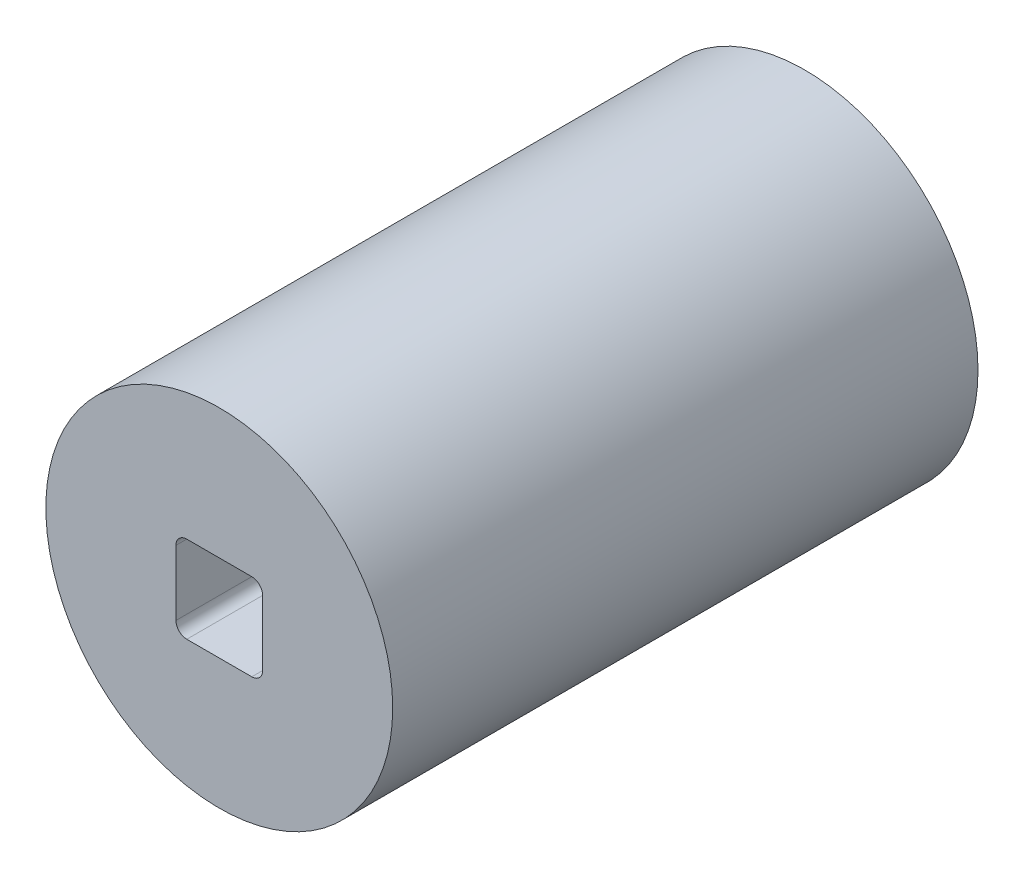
ISO-10303-21;
HEADER;
FILE_DESCRIPTION(('STEP AP214'),'2;1');
FILE_NAME('part.step','',(''),(''),'','','');
FILE_SCHEMA(('AUTOMOTIVE_DESIGN { 1 0 10303 214 1 1 1 1 }'));
ENDSEC;
DATA;
#1=APPLICATION_CONTEXT('core data for automotive mechanical design processes');
#2=APPLICATION_PROTOCOL_DEFINITION('international standard','automotive_design',2000,#1);
#3=PRODUCT_CONTEXT('',#1,'mechanical');
#4=PRODUCT('Part','Part','',(#3));
#5=PRODUCT_RELATED_PRODUCT_CATEGORY('part','',(#4));
#6=PRODUCT_DEFINITION_FORMATION('','',#4);
#7=PRODUCT_DEFINITION_CONTEXT('part definition',#1,'design');
#8=PRODUCT_DEFINITION('design','',#6,#7);
#9=PRODUCT_DEFINITION_SHAPE('','',#8);
#10=(LENGTH_UNIT() NAMED_UNIT(*) SI_UNIT(.MILLI.,.METRE.));
#11=(NAMED_UNIT(*) PLANE_ANGLE_UNIT() SI_UNIT($,.RADIAN.));
#12=(NAMED_UNIT(*) SI_UNIT($,.STERADIAN.) SOLID_ANGLE_UNIT());
#13=UNCERTAINTY_MEASURE_WITH_UNIT(LENGTH_MEASURE(1.E-05),#10,'distance_accuracy_value','');
#14=(GEOMETRIC_REPRESENTATION_CONTEXT(3) GLOBAL_UNCERTAINTY_ASSIGNED_CONTEXT((#13)) GLOBAL_UNIT_ASSIGNED_CONTEXT((#10,
#11,#12)) REPRESENTATION_CONTEXT('',''));
#15=CARTESIAN_POINT('',(0.,0.,0.));
#16=DIRECTION('',(0.,0.,1.));
#17=DIRECTION('',(1.,0.,0.));
#18=AXIS2_PLACEMENT_3D('',#15,#16,#17);
#19=CARTESIAN_POINT('',(0.,0.,-1371.6));
#20=DIRECTION('',(0.,0.,1.));
#21=DIRECTION('',(1.,0.,0.));
#22=AXIS2_PLACEMENT_3D('',#19,#20,#21);
#23=CYLINDRICAL_SURFACE('',#22,406.4);
#24=CARTESIAN_POINT('',(0.,0.,-1371.6));
#25=DIRECTION('',(0.,0.,1.));
#26=DIRECTION('',(1.,0.,0.));
#27=AXIS2_PLACEMENT_3D('',#24,#25,#26);
#28=CIRCLE('',#27,406.4);
#29=CARTESIAN_POINT('',(406.4,0.,-1371.6));
#30=VERTEX_POINT('',#29);
#31=EDGE_CURVE('E53',#30,#30,#28,.T.);
#32=ORIENTED_EDGE('',*,*,#31,.T.);
#33=EDGE_LOOP('',(#32));
#34=FACE_BOUND('',#33,.T.);
#35=CARTESIAN_POINT('',(0.,0.,0.));
#36=DIRECTION('',(0.,0.,1.));
#37=DIRECTION('',(1.,0.,0.));
#38=AXIS2_PLACEMENT_3D('',#35,#36,#37);
#39=CIRCLE('',#38,406.4);
#40=CARTESIAN_POINT('',(406.4,0.,0.));
#41=VERTEX_POINT('',#40);
#42=EDGE_CURVE('E238',#41,#41,#39,.T.);
#43=ORIENTED_EDGE('',*,*,#42,.F.);
#44=EDGE_LOOP('',(#43));
#45=FACE_BOUND('',#44,.T.);
#46=ADVANCED_FACE('F45',(#34,#45),#23,.T.);
#47=CARTESIAN_POINT('',(0.,0.,-1371.6));
#48=DIRECTION('',(0.,0.,1.));
#49=DIRECTION('',(1.,0.,0.));
#50=AXIS2_PLACEMENT_3D('',#47,#48,#49);
#51=PLANE('',#50);
#52=ORIENTED_EDGE('',*,*,#31,.F.);
#53=EDGE_LOOP('',(#52));
#54=FACE_BOUND('',#53,.T.);
#55=ADVANCED_FACE('F268',(#54),#51,.F.);
#56=CARTESIAN_POINT('',(0.,0.,0.));
#57=DIRECTION('',(0.,0.,1.));
#58=DIRECTION('',(1.,0.,0.));
#59=AXIS2_PLACEMENT_3D('',#56,#57,#58);
#60=PLANE('',#59);
#61=DIRECTION('',(0.,-1.,0.));
#62=VECTOR('',#61,1.);
#63=CARTESIAN_POINT('',(-101.6,0.,0.));
#64=LINE('',#63,#62);
#65=CARTESIAN_POINT('',(-101.6,76.2,0.));
#66=VERTEX_POINT('',#65);
#67=CARTESIAN_POINT('',(-101.6,-76.2,0.));
#68=VERTEX_POINT('',#67);
#69=EDGE_CURVE('E205',#66,#68,#64,.T.);
#70=ORIENTED_EDGE('',*,*,#69,.F.);
#71=CARTESIAN_POINT('',(-76.2,76.2,0.));
#72=DIRECTION('',(0.,0.,1.));
#73=DIRECTION('',(1.,0.,0.));
#74=AXIS2_PLACEMENT_3D('',#71,#72,#73);
#75=CIRCLE('',#74,25.4);
#76=CARTESIAN_POINT('',(-76.2,101.6,0.));
#77=VERTEX_POINT('',#76);
#78=EDGE_CURVE('E231',#77,#66,#75,.T.);
#79=ORIENTED_EDGE('',*,*,#78,.F.);
#80=DIRECTION('',(1.,0.,0.));
#81=VECTOR('',#80,1.);
#82=CARTESIAN_POINT('',(0.,101.6,0.));
#83=LINE('',#82,#81);
#84=CARTESIAN_POINT('',(76.2,101.6,0.));
#85=VERTEX_POINT('',#84);
#86=EDGE_CURVE('E227',#77,#85,#83,.T.);
#87=ORIENTED_EDGE('',*,*,#86,.T.);
#88=CARTESIAN_POINT('',(76.2,76.2,0.));
#89=DIRECTION('',(0.,0.,1.));
#90=DIRECTION('',(1.,0.,0.));
#91=AXIS2_PLACEMENT_3D('',#88,#89,#90);
#92=CIRCLE('',#91,25.4);
#93=CARTESIAN_POINT('',(101.6,76.2,0.));
#94=VERTEX_POINT('',#93);
#95=EDGE_CURVE('E223',#94,#85,#92,.T.);
#96=ORIENTED_EDGE('',*,*,#95,.F.);
#97=DIRECTION('',(0.,1.,0.));
#98=VECTOR('',#97,1.);
#99=CARTESIAN_POINT('',(101.6,0.,0.));
#100=LINE('',#99,#98);
#101=CARTESIAN_POINT('',(101.6,-76.2,0.));
#102=VERTEX_POINT('',#101);
#103=EDGE_CURVE('E219',#102,#94,#100,.T.);
#104=ORIENTED_EDGE('',*,*,#103,.F.);
#105=CARTESIAN_POINT('',(76.2,-76.2,0.));
#106=DIRECTION('',(0.,0.,1.));
#107=DIRECTION('',(1.,0.,0.));
#108=AXIS2_PLACEMENT_3D('',#105,#106,#107);
#109=CIRCLE('',#108,25.4);
#110=CARTESIAN_POINT('',(76.2,-101.6,0.));
#111=VERTEX_POINT('',#110);
#112=EDGE_CURVE('E215',#111,#102,#109,.T.);
#113=ORIENTED_EDGE('',*,*,#112,.F.);
#114=DIRECTION('',(-1.,0.,0.));
#115=VECTOR('',#114,1.);
#116=CARTESIAN_POINT('',(0.,-101.6,0.));
#117=LINE('',#116,#115);
#118=CARTESIAN_POINT('',(-76.2,-101.6,0.));
#119=VERTEX_POINT('',#118);
#120=EDGE_CURVE('E211',#111,#119,#117,.T.);
#121=ORIENTED_EDGE('',*,*,#120,.T.);
#122=CARTESIAN_POINT('',(-76.2,-76.2,0.));
#123=DIRECTION('',(0.,0.,1.));
#124=DIRECTION('',(1.,0.,0.));
#125=AXIS2_PLACEMENT_3D('',#122,#123,#124);
#126=CIRCLE('',#125,25.4);
#127=EDGE_CURVE('E208',#68,#119,#126,.T.);
#128=ORIENTED_EDGE('',*,*,#127,.F.);
#129=EDGE_LOOP('',(#70,#79,#87,#96,#104,#113,#121,#128));
#130=FACE_BOUND('',#129,.T.);
#131=ORIENTED_EDGE('',*,*,#42,.T.);
#132=EDGE_LOOP('',(#131));
#133=FACE_BOUND('',#132,.T.);
#134=ADVANCED_FACE('F265',(#130,#133),#60,.T.);
#135=CARTESIAN_POINT('',(-101.6,0.,-1330.325));
#136=DIRECTION('',(-1.,0.,0.));
#137=DIRECTION('',(0.,-1.,0.));
#138=AXIS2_PLACEMENT_3D('',#135,#136,#137);
#139=PLANE('',#138);
#140=DIRECTION('',(0.,0.,1.));
#141=VECTOR('',#140,1.);
#142=CARTESIAN_POINT('',(-101.6,-76.2,-1330.325));
#143=LINE('',#142,#141);
#144=CARTESIAN_POINT('',(-101.6,-76.2,-1311.275));
#145=VERTEX_POINT('',#144);
#146=EDGE_CURVE('E66',#145,#68,#143,.T.);
#147=ORIENTED_EDGE('',*,*,#146,.F.);
#148=DIRECTION('',(0.,1.,0.));
#149=VECTOR('',#148,1.);
#150=CARTESIAN_POINT('',(-101.6,0.,-1311.275));
#151=LINE('',#150,#149);
#152=CARTESIAN_POINT('',(-101.6,76.2,-1311.275));
#153=VERTEX_POINT('',#152);
#154=EDGE_CURVE('E60',#145,#153,#151,.T.);
#155=ORIENTED_EDGE('',*,*,#154,.T.);
#156=DIRECTION('',(0.,0.,1.));
#157=VECTOR('',#156,1.);
#158=CARTESIAN_POINT('',(-101.6,76.2,-1330.325));
#159=LINE('',#158,#157);
#160=EDGE_CURVE('E235',#153,#66,#159,.T.);
#161=ORIENTED_EDGE('',*,*,#160,.T.);
#162=ORIENTED_EDGE('',*,*,#69,.T.);
#163=EDGE_LOOP('',(#147,#155,#161,#162));
#164=FACE_BOUND('',#163,.T.);
#165=ADVANCED_FACE('F279',(#164),#139,.F.);
#166=CARTESIAN_POINT('',(-76.2,76.2,-1330.325));
#167=DIRECTION('',(0.,0.,1.));
#168=DIRECTION('',(1.,0.,0.));
#169=AXIS2_PLACEMENT_3D('',#166,#167,#168);
#170=CYLINDRICAL_SURFACE('',#169,25.4);
#171=ORIENTED_EDGE('',*,*,#160,.F.);
#172=CARTESIAN_POINT('',(-76.2,76.2,-1311.275));
#173=DIRECTION('',(0.,0.,1.));
#174=DIRECTION('',(1.,0.,0.));
#175=AXIS2_PLACEMENT_3D('',#172,#173,#174);
#176=CIRCLE('',#175,25.4);
#177=CARTESIAN_POINT('',(-76.2,101.6,-1311.275));
#178=VERTEX_POINT('',#177);
#179=EDGE_CURVE('E199',#153,#178,#176,.F.);
#180=ORIENTED_EDGE('',*,*,#179,.T.);
#181=DIRECTION('',(0.,0.,1.));
#182=VECTOR('',#181,1.);
#183=CARTESIAN_POINT('',(-76.2,101.6,-1330.325));
#184=LINE('',#183,#182);
#185=EDGE_CURVE('E239',#178,#77,#184,.T.);
#186=ORIENTED_EDGE('',*,*,#185,.T.);
#187=ORIENTED_EDGE('',*,*,#78,.T.);
#188=EDGE_LOOP('',(#171,#180,#186,#187));
#189=FACE_BOUND('',#188,.T.);
#190=ADVANCED_FACE('F284',(#189),#170,.F.);
#191=CARTESIAN_POINT('',(0.,101.6,-1330.325));
#192=DIRECTION('',(0.,-1.,0.));
#193=DIRECTION('',(0.,0.,-1.));
#194=AXIS2_PLACEMENT_3D('',#191,#192,#193);
#195=PLANE('',#194);
#196=DIRECTION('',(-1.,0.,0.));
#197=VECTOR('',#196,1.);
#198=CARTESIAN_POINT('',(0.,101.6,-1311.275));
#199=LINE('',#198,#197);
#200=CARTESIAN_POINT('',(76.2,101.6,-1311.275));
#201=VERTEX_POINT('',#200);
#202=EDGE_CURVE('E196',#201,#178,#199,.T.);
#203=ORIENTED_EDGE('',*,*,#202,.F.);
#204=DIRECTION('',(0.,0.,1.));
#205=VECTOR('',#204,1.);
#206=CARTESIAN_POINT('',(76.2,101.6,-1330.325));
#207=LINE('',#206,#205);
#208=EDGE_CURVE('E242',#201,#85,#207,.T.);
#209=ORIENTED_EDGE('',*,*,#208,.T.);
#210=ORIENTED_EDGE('',*,*,#86,.F.);
#211=ORIENTED_EDGE('',*,*,#185,.F.);
#212=EDGE_LOOP('',(#203,#209,#210,#211));
#213=FACE_BOUND('',#212,.T.);
#214=ADVANCED_FACE('F304',(#213),#195,.T.);
#215=CARTESIAN_POINT('',(76.2,76.2,-1330.325));
#216=DIRECTION('',(0.,0.,1.));
#217=DIRECTION('',(1.,0.,0.));
#218=AXIS2_PLACEMENT_3D('',#215,#216,#217);
#219=CYLINDRICAL_SURFACE('',#218,25.4);
#220=ORIENTED_EDGE('',*,*,#208,.F.);
#221=CARTESIAN_POINT('',(76.2,76.2,-1311.275));
#222=DIRECTION('',(0.,0.,1.));
#223=DIRECTION('',(1.,0.,0.));
#224=AXIS2_PLACEMENT_3D('',#221,#222,#223);
#225=CIRCLE('',#224,25.4);
#226=CARTESIAN_POINT('',(101.6,76.2,-1311.275));
#227=VERTEX_POINT('',#226);
#228=EDGE_CURVE('E192',#201,#227,#225,.F.);
#229=ORIENTED_EDGE('',*,*,#228,.T.);
#230=DIRECTION('',(0.,0.,1.));
#231=VECTOR('',#230,1.);
#232=CARTESIAN_POINT('',(101.6,76.2,-1330.325));
#233=LINE('',#232,#231);
#234=EDGE_CURVE('E245',#227,#94,#233,.T.);
#235=ORIENTED_EDGE('',*,*,#234,.T.);
#236=ORIENTED_EDGE('',*,*,#95,.T.);
#237=EDGE_LOOP('',(#220,#229,#235,#236));
#238=FACE_BOUND('',#237,.T.);
#239=ADVANCED_FACE('F300',(#238),#219,.F.);
#240=CARTESIAN_POINT('',(101.6,0.,-1330.325));
#241=DIRECTION('',(1.,0.,0.));
#242=DIRECTION('',(0.,0.,-1.));
#243=AXIS2_PLACEMENT_3D('',#240,#241,#242);
#244=PLANE('',#243);
#245=ORIENTED_EDGE('',*,*,#234,.F.);
#246=DIRECTION('',(0.,-1.,0.));
#247=VECTOR('',#246,1.);
#248=CARTESIAN_POINT('',(101.6,0.,-1311.275));
#249=LINE('',#248,#247);
#250=CARTESIAN_POINT('',(101.6,-76.2,-1311.275));
#251=VERTEX_POINT('',#250);
#252=EDGE_CURVE('E188',#227,#251,#249,.T.);
#253=ORIENTED_EDGE('',*,*,#252,.T.);
#254=DIRECTION('',(0.,0.,1.));
#255=VECTOR('',#254,1.);
#256=CARTESIAN_POINT('',(101.6,-76.2,-1330.325));
#257=LINE('',#256,#255);
#258=EDGE_CURVE('E248',#251,#102,#257,.T.);
#259=ORIENTED_EDGE('',*,*,#258,.T.);
#260=ORIENTED_EDGE('',*,*,#103,.T.);
#261=EDGE_LOOP('',(#245,#253,#259,#260));
#262=FACE_BOUND('',#261,.T.);
#263=ADVANCED_FACE('F296',(#262),#244,.F.);
#264=CARTESIAN_POINT('',(76.2,-76.2,-1330.325));
#265=DIRECTION('',(0.,0.,1.));
#266=DIRECTION('',(1.,0.,0.));
#267=AXIS2_PLACEMENT_3D('',#264,#265,#266);
#268=CYLINDRICAL_SURFACE('',#267,25.4);
#269=ORIENTED_EDGE('',*,*,#258,.F.);
#270=CARTESIAN_POINT('',(76.2,-76.2,-1311.275));
#271=DIRECTION('',(0.,0.,1.));
#272=DIRECTION('',(1.,0.,0.));
#273=AXIS2_PLACEMENT_3D('',#270,#271,#272);
#274=CIRCLE('',#273,25.4);
#275=CARTESIAN_POINT('',(76.2,-101.6,-1311.275));
#276=VERTEX_POINT('',#275);
#277=EDGE_CURVE('E179',#251,#276,#274,.F.);
#278=ORIENTED_EDGE('',*,*,#277,.T.);
#279=DIRECTION('',(0.,0.,1.));
#280=VECTOR('',#279,1.);
#281=CARTESIAN_POINT('',(76.2,-101.6,-1330.325));
#282=LINE('',#281,#280);
#283=EDGE_CURVE('E251',#276,#111,#282,.T.);
#284=ORIENTED_EDGE('',*,*,#283,.T.);
#285=ORIENTED_EDGE('',*,*,#112,.T.);
#286=EDGE_LOOP('',(#269,#278,#284,#285));
#287=FACE_BOUND('',#286,.T.);
#288=ADVANCED_FACE('F292',(#287),#268,.F.);
#289=CARTESIAN_POINT('',(0.,-101.6,-1330.325));
#290=DIRECTION('',(0.,1.,0.));
#291=DIRECTION('',(0.,0.,1.));
#292=AXIS2_PLACEMENT_3D('',#289,#290,#291);
#293=PLANE('',#292);
#294=DIRECTION('',(1.,0.,0.));
#295=VECTOR('',#294,1.);
#296=CARTESIAN_POINT('',(0.,-101.6,-1311.275));
#297=LINE('',#296,#295);
#298=CARTESIAN_POINT('',(-76.2,-101.6,-1311.275));
#299=VERTEX_POINT('',#298);
#300=EDGE_CURVE('E174',#299,#276,#297,.T.);
#301=ORIENTED_EDGE('',*,*,#300,.F.);
#302=DIRECTION('',(0.,0.,1.));
#303=VECTOR('',#302,1.);
#304=CARTESIAN_POINT('',(-76.2,-101.6,-1330.325));
#305=LINE('',#304,#303);
#306=EDGE_CURVE('E254',#299,#119,#305,.T.);
#307=ORIENTED_EDGE('',*,*,#306,.T.);
#308=ORIENTED_EDGE('',*,*,#120,.F.);
#309=ORIENTED_EDGE('',*,*,#283,.F.);
#310=EDGE_LOOP('',(#301,#307,#308,#309));
#311=FACE_BOUND('',#310,.T.);
#312=ADVANCED_FACE('F289',(#311),#293,.T.);
#313=CARTESIAN_POINT('',(-76.2,-76.2,-1330.325));
#314=DIRECTION('',(0.,0.,1.));
#315=DIRECTION('',(1.,0.,0.));
#316=AXIS2_PLACEMENT_3D('',#313,#314,#315);
#317=CYLINDRICAL_SURFACE('',#316,25.4);
#318=ORIENTED_EDGE('',*,*,#306,.F.);
#319=CARTESIAN_POINT('',(-76.2,-76.2,-1311.275));
#320=DIRECTION('',(0.,0.,1.));
#321=DIRECTION('',(1.,0.,0.));
#322=AXIS2_PLACEMENT_3D('',#319,#320,#321);
#323=CIRCLE('',#322,25.4);
#324=EDGE_CURVE('E11',#299,#145,#323,.F.);
#325=ORIENTED_EDGE('',*,*,#324,.T.);
#326=ORIENTED_EDGE('',*,*,#146,.T.);
#327=ORIENTED_EDGE('',*,*,#127,.T.);
#328=EDGE_LOOP('',(#318,#325,#326,#327));
#329=FACE_BOUND('',#328,.T.);
#330=ADVANCED_FACE('F286',(#329),#317,.F.);
#331=CARTESIAN_POINT('',(0.,0.,-1311.275));
#332=DIRECTION('',(0.,0.,1.));
#333=DIRECTION('',(1.,0.,0.));
#334=AXIS2_PLACEMENT_3D('',#331,#332,#333);
#335=PLANE('',#334);
#336=DIRECTION('',(0.,-1.,0.));
#337=VECTOR('',#336,1.);
#338=CARTESIAN_POINT('',(-228.6,131.982271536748,-1311.275));
#339=LINE('',#338,#337);
#340=CARTESIAN_POINT('',(-228.6,131.982271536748,-1311.275));
#341=VERTEX_POINT('',#340);
#342=CARTESIAN_POINT('',(-228.6,-131.982271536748,-1311.275));
#343=VERTEX_POINT('',#342);
#344=EDGE_CURVE('E150',#341,#343,#339,.T.);
#345=ORIENTED_EDGE('',*,*,#344,.F.);
#346=DIRECTION('',(-0.866025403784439,-0.5,0.));
#347=VECTOR('',#346,1.);
#348=CARTESIAN_POINT('',(0.,263.964543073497,-1311.275));
#349=LINE('',#348,#347);
#350=CARTESIAN_POINT('',(0.,263.964543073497,-1311.275));
#351=VERTEX_POINT('',#350);
#352=EDGE_CURVE('E464',#351,#341,#349,.T.);
#353=ORIENTED_EDGE('',*,*,#352,.F.);
#354=DIRECTION('',(-0.866025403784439,0.5,0.));
#355=VECTOR('',#354,1.);
#356=CARTESIAN_POINT('',(228.6,131.982271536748,-1311.275));
#357=LINE('',#356,#355);
#358=CARTESIAN_POINT('',(228.6,131.982271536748,-1311.275));
#359=VERTEX_POINT('',#358);
#360=EDGE_CURVE('E489',#359,#351,#357,.T.);
#361=ORIENTED_EDGE('',*,*,#360,.F.);
#362=DIRECTION('',(0.,1.,0.));
#363=VECTOR('',#362,1.);
#364=CARTESIAN_POINT('',(228.6,-131.982271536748,-1311.275));
#365=LINE('',#364,#363);
#366=CARTESIAN_POINT('',(228.6,-131.982271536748,-1311.275));
#367=VERTEX_POINT('',#366);
#368=EDGE_CURVE('E492',#367,#359,#365,.T.);
#369=ORIENTED_EDGE('',*,*,#368,.F.);
#370=DIRECTION('',(0.866025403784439,0.5,0.));
#371=VECTOR('',#370,1.);
#372=CARTESIAN_POINT('',(0.,-263.964543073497,-1311.275));
#373=LINE('',#372,#371);
#374=CARTESIAN_POINT('',(0.,-263.964543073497,-1311.275));
#375=VERTEX_POINT('',#374);
#376=EDGE_CURVE('E152',#375,#367,#373,.T.);
#377=ORIENTED_EDGE('',*,*,#376,.F.);
#378=DIRECTION('',(0.866025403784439,-0.5,0.));
#379=VECTOR('',#378,1.);
#380=CARTESIAN_POINT('',(-228.6,-131.982271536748,-1311.275));
#381=LINE('',#380,#379);
#382=EDGE_CURVE('E146',#343,#375,#381,.T.);
#383=ORIENTED_EDGE('',*,*,#382,.F.);
#384=EDGE_LOOP('',(#345,#353,#361,#369,#377,#383));
#385=FACE_BOUND('',#384,.T.);
#386=ORIENTED_EDGE('',*,*,#324,.F.);
#387=ORIENTED_EDGE('',*,*,#300,.T.);
#388=ORIENTED_EDGE('',*,*,#277,.F.);
#389=ORIENTED_EDGE('',*,*,#252,.F.);
#390=ORIENTED_EDGE('',*,*,#228,.F.);
#391=ORIENTED_EDGE('',*,*,#202,.T.);
#392=ORIENTED_EDGE('',*,*,#179,.F.);
#393=ORIENTED_EDGE('',*,*,#154,.F.);
#394=EDGE_LOOP('',(#386,#387,#388,#389,#390,#391,#392,#393));
#395=FACE_BOUND('',#394,.T.);
#396=ADVANCED_FACE('F148',(#385,#395),#335,.F.);
#397=CARTESIAN_POINT('',(-228.6,131.982271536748,-1311.275));
#398=DIRECTION('',(1.,0.,0.));
#399=DIRECTION('',(0.,1.,0.));
#400=AXIS2_PLACEMENT_3D('',#397,#398,#399);
#401=PLANE('',#400);
#402=DIRECTION('',(0.,-1.,0.));
#403=VECTOR('',#402,1.);
#404=CARTESIAN_POINT('',(-228.6,131.982271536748,-1330.325));
#405=LINE('',#404,#403);
#406=CARTESIAN_POINT('',(-228.6,131.982271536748,-1330.325));
#407=VERTEX_POINT('',#406);
#408=CARTESIAN_POINT('',(-228.6,-131.982271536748,-1330.325));
#409=VERTEX_POINT('',#408);
#410=EDGE_CURVE('E484',#407,#409,#405,.T.);
#411=ORIENTED_EDGE('',*,*,#410,.F.);
#412=DIRECTION('',(0.,0.,-1.));
#413=VECTOR('',#412,1.);
#414=CARTESIAN_POINT('',(-228.6,131.982271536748,-1311.275));
#415=LINE('',#414,#413);
#416=EDGE_CURVE('E167',#341,#407,#415,.T.);
#417=ORIENTED_EDGE('',*,*,#416,.F.);
#418=ORIENTED_EDGE('',*,*,#344,.T.);
#419=DIRECTION('',(0.,0.,-1.));
#420=VECTOR('',#419,1.);
#421=CARTESIAN_POINT('',(-228.6,-131.982271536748,-1311.275));
#422=LINE('',#421,#420);
#423=EDGE_CURVE('E164',#343,#409,#422,.T.);
#424=ORIENTED_EDGE('',*,*,#423,.T.);
#425=EDGE_LOOP('',(#411,#417,#418,#424));
#426=FACE_BOUND('',#425,.T.);
#427=ADVANCED_FACE('F163',(#426),#401,.T.);
#428=CARTESIAN_POINT('',(-228.6,-131.982271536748,-1311.275));
#429=DIRECTION('',(0.5,0.866025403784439,0.));
#430=DIRECTION('',(-0.866025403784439,0.5,0.));
#431=AXIS2_PLACEMENT_3D('',#428,#429,#430);
#432=PLANE('',#431);
#433=DIRECTION('',(0.866025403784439,-0.5,0.));
#434=VECTOR('',#433,1.);
#435=CARTESIAN_POINT('',(-228.6,-131.982271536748,-1330.325));
#436=LINE('',#435,#434);
#437=CARTESIAN_POINT('',(0.,-263.964543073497,-1330.325));
#438=VERTEX_POINT('',#437);
#439=EDGE_CURVE('E172',#409,#438,#436,.T.);
#440=ORIENTED_EDGE('',*,*,#439,.F.);
#441=ORIENTED_EDGE('',*,*,#423,.F.);
#442=ORIENTED_EDGE('',*,*,#382,.T.);
#443=DIRECTION('',(0.,0.,-1.));
#444=VECTOR('',#443,1.);
#445=CARTESIAN_POINT('',(0.,-263.964543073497,-1311.275));
#446=LINE('',#445,#444);
#447=EDGE_CURVE('E175',#375,#438,#446,.T.);
#448=ORIENTED_EDGE('',*,*,#447,.T.);
#449=EDGE_LOOP('',(#440,#441,#442,#448));
#450=FACE_BOUND('',#449,.T.);
#451=ADVANCED_FACE('F171',(#450),#432,.T.);
#452=CARTESIAN_POINT('',(0.,-263.964543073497,-1311.275));
#453=DIRECTION('',(-0.5,0.866025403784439,0.));
#454=DIRECTION('',(-0.866025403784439,-0.5,0.));
#455=AXIS2_PLACEMENT_3D('',#452,#453,#454);
#456=PLANE('',#455);
#457=DIRECTION('',(0.866025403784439,0.5,0.));
#458=VECTOR('',#457,1.);
#459=CARTESIAN_POINT('',(0.,-263.964543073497,-1330.325));
#460=LINE('',#459,#458);
#461=CARTESIAN_POINT('',(228.6,-131.982271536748,-1330.325));
#462=VERTEX_POINT('',#461);
#463=EDGE_CURVE('E475',#438,#462,#460,.T.);
#464=ORIENTED_EDGE('',*,*,#463,.F.);
#465=ORIENTED_EDGE('',*,*,#447,.F.);
#466=ORIENTED_EDGE('',*,*,#376,.T.);
#467=DIRECTION('',(0.,0.,-1.));
#468=VECTOR('',#467,1.);
#469=CARTESIAN_POINT('',(228.6,-131.982271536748,-1311.275));
#470=LINE('',#469,#468);
#471=EDGE_CURVE('E181',#367,#462,#470,.T.);
#472=ORIENTED_EDGE('',*,*,#471,.T.);
#473=EDGE_LOOP('',(#464,#465,#466,#472));
#474=FACE_BOUND('',#473,.T.);
#475=ADVANCED_FACE('F321',(#474),#456,.T.);
#476=CARTESIAN_POINT('',(228.6,-131.982271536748,-1311.275));
#477=DIRECTION('',(-1.,0.,0.));
#478=DIRECTION('',(0.,0.,1.));
#479=AXIS2_PLACEMENT_3D('',#476,#477,#478);
#480=PLANE('',#479);
#481=DIRECTION('',(0.,1.,0.));
#482=VECTOR('',#481,1.);
#483=CARTESIAN_POINT('',(228.6,-131.982271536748,-1330.325));
#484=LINE('',#483,#482);
#485=CARTESIAN_POINT('',(228.6,131.982271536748,-1330.325));
#486=VERTEX_POINT('',#485);
#487=EDGE_CURVE('E458',#462,#486,#484,.T.);
#488=ORIENTED_EDGE('',*,*,#487,.F.);
#489=ORIENTED_EDGE('',*,*,#471,.F.);
#490=ORIENTED_EDGE('',*,*,#368,.T.);
#491=DIRECTION('',(0.,0.,-1.));
#492=VECTOR('',#491,1.);
#493=CARTESIAN_POINT('',(228.6,131.982271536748,-1311.275));
#494=LINE('',#493,#492);
#495=EDGE_CURVE('E467',#359,#486,#494,.T.);
#496=ORIENTED_EDGE('',*,*,#495,.T.);
#497=EDGE_LOOP('',(#488,#489,#490,#496));
#498=FACE_BOUND('',#497,.T.);
#499=ADVANCED_FACE('F324',(#498),#480,.T.);
#500=CARTESIAN_POINT('',(228.6,131.982271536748,-1311.275));
#501=DIRECTION('',(-0.5,-0.866025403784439,0.));
#502=DIRECTION('',(0.866025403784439,-0.5,0.));
#503=AXIS2_PLACEMENT_3D('',#500,#501,#502);
#504=PLANE('',#503);
#505=DIRECTION('',(-0.866025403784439,0.5,0.));
#506=VECTOR('',#505,1.);
#507=CARTESIAN_POINT('',(228.6,131.982271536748,-1330.325));
#508=LINE('',#507,#506);
#509=CARTESIAN_POINT('',(0.,263.964543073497,-1330.325));
#510=VERTEX_POINT('',#509);
#511=EDGE_CURVE('E455',#486,#510,#508,.T.);
#512=ORIENTED_EDGE('',*,*,#511,.F.);
#513=ORIENTED_EDGE('',*,*,#495,.F.);
#514=ORIENTED_EDGE('',*,*,#360,.T.);
#515=DIRECTION('',(0.,0.,-1.));
#516=VECTOR('',#515,1.);
#517=CARTESIAN_POINT('',(0.,263.964543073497,-1311.275));
#518=LINE('',#517,#516);
#519=EDGE_CURVE('E453',#351,#510,#518,.T.);
#520=ORIENTED_EDGE('',*,*,#519,.T.);
#521=EDGE_LOOP('',(#512,#513,#514,#520));
#522=FACE_BOUND('',#521,.T.);
#523=ADVANCED_FACE('F328',(#522),#504,.T.);
#524=CARTESIAN_POINT('',(0.,263.964543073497,-1311.275));
#525=DIRECTION('',(0.5,-0.866025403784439,0.));
#526=DIRECTION('',(0.866025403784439,0.5,0.));
#527=AXIS2_PLACEMENT_3D('',#524,#525,#526);
#528=PLANE('',#527);
#529=DIRECTION('',(-0.866025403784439,-0.5,0.));
#530=VECTOR('',#529,1.);
#531=CARTESIAN_POINT('',(0.,263.964543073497,-1330.325));
#532=LINE('',#531,#530);
#533=EDGE_CURVE('E169',#510,#407,#532,.T.);
#534=ORIENTED_EDGE('',*,*,#533,.F.);
#535=ORIENTED_EDGE('',*,*,#519,.F.);
#536=ORIENTED_EDGE('',*,*,#352,.T.);
#537=ORIENTED_EDGE('',*,*,#416,.T.);
#538=EDGE_LOOP('',(#534,#535,#536,#537));
#539=FACE_BOUND('',#538,.T.);
#540=ADVANCED_FACE('F315',(#539),#528,.T.);
#541=CARTESIAN_POINT('',(0.,0.,-1330.325));
#542=DIRECTION('',(0.,0.,1.));
#543=DIRECTION('',(1.,0.,0.));
#544=AXIS2_PLACEMENT_3D('',#541,#542,#543);
#545=PLANE('',#544);
#546=ORIENTED_EDGE('',*,*,#410,.T.);
#547=ORIENTED_EDGE('',*,*,#439,.T.);
#548=ORIENTED_EDGE('',*,*,#463,.T.);
#549=ORIENTED_EDGE('',*,*,#487,.T.);
#550=ORIENTED_EDGE('',*,*,#511,.T.);
#551=ORIENTED_EDGE('',*,*,#533,.T.);
#552=EDGE_LOOP('',(#546,#547,#548,#549,#550,#551));
#553=FACE_BOUND('',#552,.T.);
#554=ADVANCED_FACE('F312',(#553),#545,.T.);
#555=CLOSED_SHELL('',(#46,#55,#134,#165,#190,#214,#239,#263,#288,#312,#330,#396,#427,#451,#475,
#499,#523,#540,#554));
#556=MANIFOLD_SOLID_BREP('B2',#555);
#557=ADVANCED_BREP_SHAPE_REPRESENTATION('',(#18,#556),#14);
#558=SHAPE_DEFINITION_REPRESENTATION(#9,#557);
ENDSEC;
END-ISO-10303-21;
